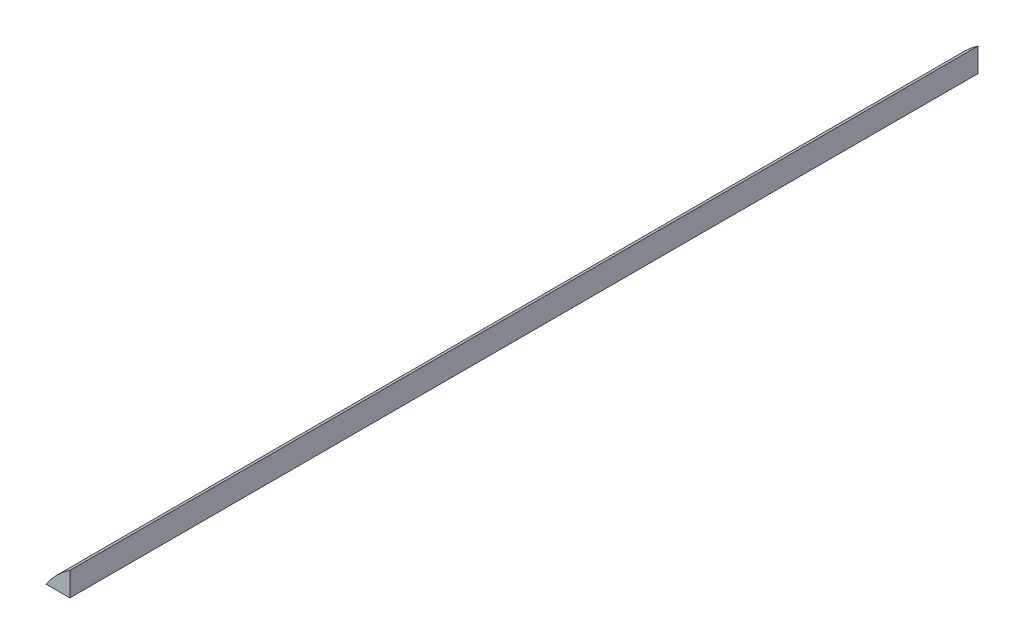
ISO-10303-21;
HEADER;
FILE_DESCRIPTION(('STEP AP214'),'2;1');
FILE_NAME('part.step','',(''),(''),'','','');
FILE_SCHEMA(('AUTOMOTIVE_DESIGN { 1 0 10303 214 1 1 1 1 }'));
ENDSEC;
DATA;
#1=APPLICATION_CONTEXT('core data for automotive mechanical design processes');
#2=APPLICATION_PROTOCOL_DEFINITION('international standard','automotive_design',2000,#1);
#3=PRODUCT_CONTEXT('',#1,'mechanical');
#4=PRODUCT('Part','Part','',(#3));
#5=PRODUCT_RELATED_PRODUCT_CATEGORY('part','',(#4));
#6=PRODUCT_DEFINITION_FORMATION('','',#4);
#7=PRODUCT_DEFINITION_CONTEXT('part definition',#1,'design');
#8=PRODUCT_DEFINITION('design','',#6,#7);
#9=PRODUCT_DEFINITION_SHAPE('','',#8);
#10=(LENGTH_UNIT() NAMED_UNIT(*) SI_UNIT(.MILLI.,.METRE.));
#11=(NAMED_UNIT(*) PLANE_ANGLE_UNIT() SI_UNIT($,.RADIAN.));
#12=(NAMED_UNIT(*) SI_UNIT($,.STERADIAN.) SOLID_ANGLE_UNIT());
#13=UNCERTAINTY_MEASURE_WITH_UNIT(LENGTH_MEASURE(1.E-05),#10,'distance_accuracy_value','');
#14=(GEOMETRIC_REPRESENTATION_CONTEXT(3) GLOBAL_UNCERTAINTY_ASSIGNED_CONTEXT((#13)) GLOBAL_UNIT_ASSIGNED_CONTEXT((#10,
#11,#12)) REPRESENTATION_CONTEXT('',''));
#15=CARTESIAN_POINT('',(0.,0.,0.));
#16=DIRECTION('',(0.,0.,1.));
#17=DIRECTION('',(1.,0.,0.));
#18=AXIS2_PLACEMENT_3D('',#15,#16,#17);
#19=CARTESIAN_POINT('',(0.,0.,203.2));
#20=DIRECTION('',(0.,0.,-1.));
#21=DIRECTION('',(-1.,0.,0.));
#22=AXIS2_PLACEMENT_3D('',#19,#20,#21);
#23=CYLINDRICAL_SURFACE('',#22,19.05);
#24=DIRECTION('',(0.,0.,1.));
#25=VECTOR('',#24,1.);
#26=CARTESIAN_POINT('',(-10.541,15.8678864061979,0.));
#27=LINE('',#26,#25);
#28=CARTESIAN_POINT('',(-10.541,15.8678864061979,0.));
#29=VERTEX_POINT('',#28);
#30=CARTESIAN_POINT('',(-10.541,15.8678864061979,203.2));
#31=VERTEX_POINT('',#30);
#32=EDGE_CURVE('E63',#29,#31,#27,.T.);
#33=ORIENTED_EDGE('',*,*,#32,.F.);
#34=CARTESIAN_POINT('',(0.,0.,0.));
#35=DIRECTION('',(0.,0.,1.));
#36=DIRECTION('',(1.,0.,0.));
#37=AXIS2_PLACEMENT_3D('',#34,#35,#36);
#38=CIRCLE('',#37,19.05);
#39=CARTESIAN_POINT('',(-15.875,10.5302837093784,0.));
#40=VERTEX_POINT('',#39);
#41=EDGE_CURVE('E39',#29,#40,#38,.T.);
#42=ORIENTED_EDGE('',*,*,#41,.T.);
#43=DIRECTION('',(0.,0.,1.));
#44=VECTOR('',#43,1.);
#45=CARTESIAN_POINT('',(-15.875,10.5302837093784,0.));
#46=LINE('',#45,#44);
#47=CARTESIAN_POINT('',(-15.875,10.5302837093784,203.2));
#48=VERTEX_POINT('',#47);
#49=EDGE_CURVE('E77',#40,#48,#46,.T.);
#50=ORIENTED_EDGE('',*,*,#49,.T.);
#51=CARTESIAN_POINT('',(0.,0.,203.2));
#52=DIRECTION('',(0.,0.,1.));
#53=DIRECTION('',(1.,0.,0.));
#54=AXIS2_PLACEMENT_3D('',#51,#52,#53);
#55=CIRCLE('',#54,19.05);
#56=EDGE_CURVE('E12',#31,#48,#55,.T.);
#57=ORIENTED_EDGE('',*,*,#56,.F.);
#58=EDGE_LOOP('',(#33,#42,#50,#57));
#59=FACE_BOUND('',#58,.T.);
#60=ADVANCED_FACE('F32',(#59),#23,.T.);
#61=CARTESIAN_POINT('',(0.,0.,203.2));
#62=DIRECTION('',(0.,0.,1.));
#63=DIRECTION('',(1.,0.,0.));
#64=AXIS2_PLACEMENT_3D('',#61,#62,#63);
#65=PLANE('',#64);
#66=DIRECTION('',(-1.,0.,0.));
#67=VECTOR('',#66,1.);
#68=CARTESIAN_POINT('',(-15.875,10.5302837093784,203.2));
#69=LINE('',#68,#67);
#70=CARTESIAN_POINT('',(-10.541,10.5302837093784,203.2));
#71=VERTEX_POINT('',#70);
#72=EDGE_CURVE('E68',#71,#48,#69,.T.);
#73=ORIENTED_EDGE('',*,*,#72,.F.);
#74=DIRECTION('',(0.,1.,0.));
#75=VECTOR('',#74,1.);
#76=CARTESIAN_POINT('',(-10.541,10.5302837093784,203.2));
#77=LINE('',#76,#75);
#78=EDGE_CURVE('E46',#71,#31,#77,.T.);
#79=ORIENTED_EDGE('',*,*,#78,.T.);
#80=ORIENTED_EDGE('',*,*,#56,.T.);
#81=EDGE_LOOP('',(#73,#79,#80));
#82=FACE_BOUND('',#81,.T.);
#83=ADVANCED_FACE('F73',(#82),#65,.T.);
#84=CARTESIAN_POINT('',(0.,0.,0.));
#85=DIRECTION('',(0.,0.,1.));
#86=DIRECTION('',(1.,0.,0.));
#87=AXIS2_PLACEMENT_3D('',#84,#85,#86);
#88=PLANE('',#87);
#89=DIRECTION('',(0.,1.,0.));
#90=VECTOR('',#89,1.);
#91=CARTESIAN_POINT('',(-10.541,10.5302837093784,0.));
#92=LINE('',#91,#90);
#93=CARTESIAN_POINT('',(-10.541,10.5302837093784,0.));
#94=VERTEX_POINT('',#93);
#95=EDGE_CURVE('E66',#94,#29,#92,.T.);
#96=ORIENTED_EDGE('',*,*,#95,.F.);
#97=DIRECTION('',(-1.,0.,0.));
#98=VECTOR('',#97,1.);
#99=CARTESIAN_POINT('',(-15.875,10.5302837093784,0.));
#100=LINE('',#99,#98);
#101=EDGE_CURVE('E80',#94,#40,#100,.T.);
#102=ORIENTED_EDGE('',*,*,#101,.T.);
#103=ORIENTED_EDGE('',*,*,#41,.F.);
#104=EDGE_LOOP('',(#96,#102,#103));
#105=FACE_BOUND('',#104,.T.);
#106=ADVANCED_FACE('F88',(#105),#88,.F.);
#107=CARTESIAN_POINT('',(-15.875,10.5302837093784,0.));
#108=DIRECTION('',(0.,1.,0.));
#109=DIRECTION('',(0.,0.,1.));
#110=AXIS2_PLACEMENT_3D('',#107,#108,#109);
#111=PLANE('',#110);
#112=DIRECTION('',(0.,0.,1.));
#113=VECTOR('',#112,1.);
#114=CARTESIAN_POINT('',(-10.541,10.5302837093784,0.));
#115=LINE('',#114,#113);
#116=EDGE_CURVE('E69',#94,#71,#115,.T.);
#117=ORIENTED_EDGE('',*,*,#116,.T.);
#118=ORIENTED_EDGE('',*,*,#72,.T.);
#119=ORIENTED_EDGE('',*,*,#49,.F.);
#120=ORIENTED_EDGE('',*,*,#101,.F.);
#121=EDGE_LOOP('',(#117,#118,#119,#120));
#122=FACE_BOUND('',#121,.T.);
#123=ADVANCED_FACE('F86',(#122),#111,.F.);
#124=CARTESIAN_POINT('',(-10.541,10.5302837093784,0.));
#125=DIRECTION('',(1.,0.,0.));
#126=DIRECTION('',(0.,0.,-1.));
#127=AXIS2_PLACEMENT_3D('',#124,#125,#126);
#128=PLANE('',#127);
#129=ORIENTED_EDGE('',*,*,#78,.F.);
#130=ORIENTED_EDGE('',*,*,#116,.F.);
#131=ORIENTED_EDGE('',*,*,#95,.T.);
#132=ORIENTED_EDGE('',*,*,#32,.T.);
#133=EDGE_LOOP('',(#129,#130,#131,#132));
#134=FACE_BOUND('',#133,.T.);
#135=ADVANCED_FACE('F64',(#134),#128,.T.);
#136=CLOSED_SHELL('',(#60,#83,#106,#123,#135));
#137=MANIFOLD_SOLID_BREP('B2',#136);
#138=ADVANCED_BREP_SHAPE_REPRESENTATION('',(#18,#137),#14);
#139=SHAPE_DEFINITION_REPRESENTATION(#9,#138);
ENDSEC;
END-ISO-10303-21;
